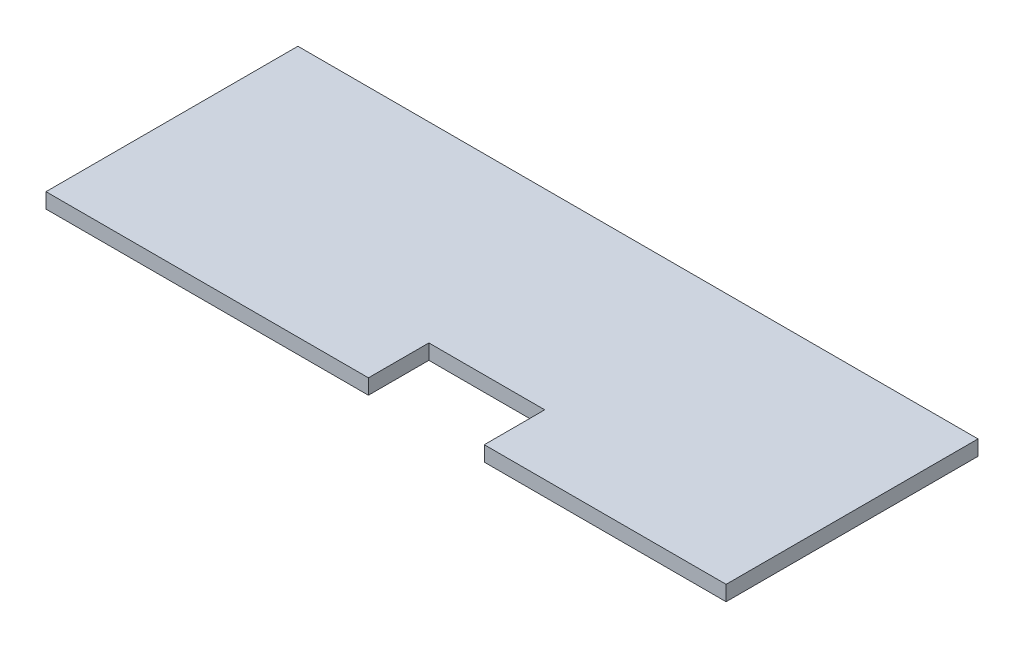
ISO-10303-21;
HEADER;
FILE_DESCRIPTION(('STEP AP214'),'2;1');
FILE_NAME('part.step','',(''),(''),'','','');
FILE_SCHEMA(('AUTOMOTIVE_DESIGN { 1 0 10303 214 1 1 1 1 }'));
ENDSEC;
DATA;
#1=APPLICATION_CONTEXT('core data for automotive mechanical design processes');
#2=APPLICATION_PROTOCOL_DEFINITION('international standard','automotive_design',2000,#1);
#3=PRODUCT_CONTEXT('',#1,'mechanical');
#4=PRODUCT('Part','Part','',(#3));
#5=PRODUCT_RELATED_PRODUCT_CATEGORY('part','',(#4));
#6=PRODUCT_DEFINITION_FORMATION('','',#4);
#7=PRODUCT_DEFINITION_CONTEXT('part definition',#1,'design');
#8=PRODUCT_DEFINITION('design','',#6,#7);
#9=PRODUCT_DEFINITION_SHAPE('','',#8);
#10=(LENGTH_UNIT() NAMED_UNIT(*) SI_UNIT(.MILLI.,.METRE.));
#11=(NAMED_UNIT(*) PLANE_ANGLE_UNIT() SI_UNIT($,.RADIAN.));
#12=(NAMED_UNIT(*) SI_UNIT($,.STERADIAN.) SOLID_ANGLE_UNIT());
#13=UNCERTAINTY_MEASURE_WITH_UNIT(LENGTH_MEASURE(1.E-05),#10,'distance_accuracy_value','');
#14=(GEOMETRIC_REPRESENTATION_CONTEXT(3) GLOBAL_UNCERTAINTY_ASSIGNED_CONTEXT((#13)) GLOBAL_UNIT_ASSIGNED_CONTEXT((#10,
#11,#12)) REPRESENTATION_CONTEXT('',''));
#15=CARTESIAN_POINT('',(0.,0.,0.));
#16=DIRECTION('',(0.,0.,1.));
#17=DIRECTION('',(1.,0.,0.));
#18=AXIS2_PLACEMENT_3D('',#15,#16,#17);
#19=CARTESIAN_POINT('',(19.5,3.,0.));
#20=DIRECTION('',(-1.,0.,0.));
#21=DIRECTION('',(0.,0.,1.));
#22=AXIS2_PLACEMENT_3D('',#19,#20,#21);
#23=PLANE('',#22);
#24=DIRECTION('',(0.,0.,-1.));
#25=VECTOR('',#24,1.);
#26=CARTESIAN_POINT('',(19.5,0.,0.));
#27=LINE('',#26,#25);
#28=CARTESIAN_POINT('',(19.5,0.,25.));
#29=VERTEX_POINT('',#28);
#30=CARTESIAN_POINT('',(19.5,0.,13.));
#31=VERTEX_POINT('',#30);
#32=EDGE_CURVE('E131',#29,#31,#27,.T.);
#33=ORIENTED_EDGE('',*,*,#32,.F.);
#34=DIRECTION('',(0.,-1.,0.));
#35=VECTOR('',#34,1.);
#36=CARTESIAN_POINT('',(19.5,3.,25.));
#37=LINE('',#36,#35);
#38=CARTESIAN_POINT('',(19.5,3.,25.));
#39=VERTEX_POINT('',#38);
#40=EDGE_CURVE('E11',#39,#29,#37,.T.);
#41=ORIENTED_EDGE('',*,*,#40,.F.);
#42=DIRECTION('',(0.,0.,-1.));
#43=VECTOR('',#42,1.);
#44=CARTESIAN_POINT('',(19.5,3.,0.));
#45=LINE('',#44,#43);
#46=CARTESIAN_POINT('',(19.5,3.,13.));
#47=VERTEX_POINT('',#46);
#48=EDGE_CURVE('E148',#39,#47,#45,.T.);
#49=ORIENTED_EDGE('',*,*,#48,.T.);
#50=DIRECTION('',(0.,-1.,0.));
#51=VECTOR('',#50,1.);
#52=CARTESIAN_POINT('',(19.5,3.,13.));
#53=LINE('',#52,#51);
#54=EDGE_CURVE('E87',#47,#31,#53,.T.);
#55=ORIENTED_EDGE('',*,*,#54,.T.);
#56=EDGE_LOOP('',(#33,#41,#49,#55));
#57=FACE_BOUND('',#56,.T.);
#58=ADVANCED_FACE('F36',(#57),#23,.T.);
#59=CARTESIAN_POINT('',(0.,3.,25.));
#60=DIRECTION('',(0.,0.,-1.));
#61=DIRECTION('',(-1.,0.,0.));
#62=AXIS2_PLACEMENT_3D('',#59,#60,#61);
#63=PLANE('',#62);
#64=DIRECTION('',(1.,0.,0.));
#65=VECTOR('',#64,1.);
#66=CARTESIAN_POINT('',(0.,0.,25.));
#67=LINE('',#66,#65);
#68=CARTESIAN_POINT('',(67.5,0.,25.));
#69=VERTEX_POINT('',#68);
#70=EDGE_CURVE('E134',#29,#69,#67,.T.);
#71=ORIENTED_EDGE('',*,*,#70,.T.);
#72=DIRECTION('',(0.,-1.,0.));
#73=VECTOR('',#72,1.);
#74=CARTESIAN_POINT('',(67.5,3.,25.));
#75=LINE('',#74,#73);
#76=CARTESIAN_POINT('',(67.5,3.,25.));
#77=VERTEX_POINT('',#76);
#78=EDGE_CURVE('E44',#77,#69,#75,.T.);
#79=ORIENTED_EDGE('',*,*,#78,.F.);
#80=DIRECTION('',(1.,0.,0.));
#81=VECTOR('',#80,1.);
#82=CARTESIAN_POINT('',(0.,3.,25.));
#83=LINE('',#82,#81);
#84=EDGE_CURVE('E117',#39,#77,#83,.T.);
#85=ORIENTED_EDGE('',*,*,#84,.F.);
#86=ORIENTED_EDGE('',*,*,#40,.T.);
#87=EDGE_LOOP('',(#71,#79,#85,#86));
#88=FACE_BOUND('',#87,.T.);
#89=ADVANCED_FACE('F175',(#88),#63,.F.);
#90=CARTESIAN_POINT('',(67.5,3.,0.));
#91=DIRECTION('',(-1.,0.,0.));
#92=DIRECTION('',(0.,0.,1.));
#93=AXIS2_PLACEMENT_3D('',#90,#91,#92);
#94=PLANE('',#93);
#95=DIRECTION('',(0.,0.,-1.));
#96=VECTOR('',#95,1.);
#97=CARTESIAN_POINT('',(67.5,0.,0.));
#98=LINE('',#97,#96);
#99=CARTESIAN_POINT('',(67.5,0.,-25.));
#100=VERTEX_POINT('',#99);
#101=EDGE_CURVE('E136',#69,#100,#98,.T.);
#102=ORIENTED_EDGE('',*,*,#101,.T.);
#103=DIRECTION('',(0.,-1.,0.));
#104=VECTOR('',#103,1.);
#105=CARTESIAN_POINT('',(67.5,3.,-25.));
#106=LINE('',#105,#104);
#107=CARTESIAN_POINT('',(67.5,3.,-25.));
#108=VERTEX_POINT('',#107);
#109=EDGE_CURVE('E154',#108,#100,#106,.T.);
#110=ORIENTED_EDGE('',*,*,#109,.F.);
#111=DIRECTION('',(0.,0.,-1.));
#112=VECTOR('',#111,1.);
#113=CARTESIAN_POINT('',(67.5,3.,0.));
#114=LINE('',#113,#112);
#115=EDGE_CURVE('E162',#77,#108,#114,.T.);
#116=ORIENTED_EDGE('',*,*,#115,.F.);
#117=ORIENTED_EDGE('',*,*,#78,.T.);
#118=EDGE_LOOP('',(#102,#110,#116,#117));
#119=FACE_BOUND('',#118,.T.);
#120=ADVANCED_FACE('F160',(#119),#94,.F.);
#121=CARTESIAN_POINT('',(0.,3.,-25.));
#122=DIRECTION('',(0.,0.,-1.));
#123=DIRECTION('',(-1.,0.,0.));
#124=AXIS2_PLACEMENT_3D('',#121,#122,#123);
#125=PLANE('',#124);
#126=DIRECTION('',(1.,0.,0.));
#127=VECTOR('',#126,1.);
#128=CARTESIAN_POINT('',(0.,0.,-25.));
#129=LINE('',#128,#127);
#130=CARTESIAN_POINT('',(-67.5,0.,-25.));
#131=VERTEX_POINT('',#130);
#132=EDGE_CURVE('E139',#131,#100,#129,.T.);
#133=ORIENTED_EDGE('',*,*,#132,.F.);
#134=DIRECTION('',(0.,-1.,0.));
#135=VECTOR('',#134,1.);
#136=CARTESIAN_POINT('',(-67.5,3.,-25.));
#137=LINE('',#136,#135);
#138=CARTESIAN_POINT('',(-67.5,3.,-25.));
#139=VERTEX_POINT('',#138);
#140=EDGE_CURVE('E152',#139,#131,#137,.T.);
#141=ORIENTED_EDGE('',*,*,#140,.F.);
#142=DIRECTION('',(1.,0.,0.));
#143=VECTOR('',#142,1.);
#144=CARTESIAN_POINT('',(0.,3.,-25.));
#145=LINE('',#144,#143);
#146=EDGE_CURVE('E172',#139,#108,#145,.T.);
#147=ORIENTED_EDGE('',*,*,#146,.T.);
#148=ORIENTED_EDGE('',*,*,#109,.T.);
#149=EDGE_LOOP('',(#133,#141,#147,#148));
#150=FACE_BOUND('',#149,.T.);
#151=ADVANCED_FACE('F170',(#150),#125,.T.);
#152=CARTESIAN_POINT('',(-67.5,3.,0.));
#153=DIRECTION('',(-1.,0.,0.));
#154=DIRECTION('',(0.,0.,1.));
#155=AXIS2_PLACEMENT_3D('',#152,#153,#154);
#156=PLANE('',#155);
#157=DIRECTION('',(0.,0.,-1.));
#158=VECTOR('',#157,1.);
#159=CARTESIAN_POINT('',(-67.5,0.,0.));
#160=LINE('',#159,#158);
#161=CARTESIAN_POINT('',(-67.5,0.,25.));
#162=VERTEX_POINT('',#161);
#163=EDGE_CURVE('E142',#162,#131,#160,.T.);
#164=ORIENTED_EDGE('',*,*,#163,.F.);
#165=DIRECTION('',(0.,-1.,0.));
#166=VECTOR('',#165,1.);
#167=CARTESIAN_POINT('',(-67.5,3.,25.));
#168=LINE('',#167,#166);
#169=CARTESIAN_POINT('',(-67.5,3.,25.));
#170=VERTEX_POINT('',#169);
#171=EDGE_CURVE('E122',#170,#162,#168,.T.);
#172=ORIENTED_EDGE('',*,*,#171,.F.);
#173=DIRECTION('',(0.,0.,-1.));
#174=VECTOR('',#173,1.);
#175=CARTESIAN_POINT('',(-67.5,3.,0.));
#176=LINE('',#175,#174);
#177=EDGE_CURVE('E114',#170,#139,#176,.T.);
#178=ORIENTED_EDGE('',*,*,#177,.T.);
#179=ORIENTED_EDGE('',*,*,#140,.T.);
#180=EDGE_LOOP('',(#164,#172,#178,#179));
#181=FACE_BOUND('',#180,.T.);
#182=ADVANCED_FACE('F185',(#181),#156,.T.);
#183=CARTESIAN_POINT('',(-3.50000000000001,0.,25.));
#184=VERTEX_POINT('',#183);
#185=EDGE_CURVE('E121',#162,#184,#67,.T.);
#186=ORIENTED_EDGE('',*,*,#185,.T.);
#187=DIRECTION('',(0.,-1.,0.));
#188=VECTOR('',#187,1.);
#189=CARTESIAN_POINT('',(-3.50000000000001,3.,25.));
#190=LINE('',#189,#188);
#191=CARTESIAN_POINT('',(-3.50000000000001,3.,25.));
#192=VERTEX_POINT('',#191);
#193=EDGE_CURVE('E118',#192,#184,#190,.T.);
#194=ORIENTED_EDGE('',*,*,#193,.F.);
#195=EDGE_CURVE('E107',#170,#192,#83,.T.);
#196=ORIENTED_EDGE('',*,*,#195,.F.);
#197=ORIENTED_EDGE('',*,*,#171,.T.);
#198=EDGE_LOOP('',(#186,#194,#196,#197));
#199=FACE_BOUND('',#198,.T.);
#200=ADVANCED_FACE('F119',(#199),#63,.F.);
#201=CARTESIAN_POINT('',(-3.50000000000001,3.,0.));
#202=DIRECTION('',(-1.,0.,0.));
#203=DIRECTION('',(0.,0.,1.));
#204=AXIS2_PLACEMENT_3D('',#201,#202,#203);
#205=PLANE('',#204);
#206=DIRECTION('',(0.,0.,-1.));
#207=VECTOR('',#206,1.);
#208=CARTESIAN_POINT('',(-3.50000000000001,0.,0.));
#209=LINE('',#208,#207);
#210=CARTESIAN_POINT('',(-3.50000000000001,0.,13.));
#211=VERTEX_POINT('',#210);
#212=EDGE_CURVE('E80',#184,#211,#209,.T.);
#213=ORIENTED_EDGE('',*,*,#212,.T.);
#214=DIRECTION('',(0.,-1.,0.));
#215=VECTOR('',#214,1.);
#216=CARTESIAN_POINT('',(-3.50000000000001,3.,13.));
#217=LINE('',#216,#215);
#218=CARTESIAN_POINT('',(-3.50000000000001,3.,13.));
#219=VERTEX_POINT('',#218);
#220=EDGE_CURVE('E123',#219,#211,#217,.T.);
#221=ORIENTED_EDGE('',*,*,#220,.F.);
#222=DIRECTION('',(0.,0.,-1.));
#223=VECTOR('',#222,1.);
#224=CARTESIAN_POINT('',(-3.50000000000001,3.,0.));
#225=LINE('',#224,#223);
#226=EDGE_CURVE('E111',#192,#219,#225,.T.);
#227=ORIENTED_EDGE('',*,*,#226,.F.);
#228=ORIENTED_EDGE('',*,*,#193,.T.);
#229=EDGE_LOOP('',(#213,#221,#227,#228));
#230=FACE_BOUND('',#229,.T.);
#231=ADVANCED_FACE('F125',(#230),#205,.F.);
#232=CARTESIAN_POINT('',(0.,3.,13.));
#233=DIRECTION('',(0.,0.,-1.));
#234=DIRECTION('',(-1.,0.,0.));
#235=AXIS2_PLACEMENT_3D('',#232,#233,#234);
#236=PLANE('',#235);
#237=DIRECTION('',(1.,0.,0.));
#238=VECTOR('',#237,1.);
#239=CARTESIAN_POINT('',(0.,0.,13.));
#240=LINE('',#239,#238);
#241=EDGE_CURVE('E146',#211,#31,#240,.T.);
#242=ORIENTED_EDGE('',*,*,#241,.T.);
#243=ORIENTED_EDGE('',*,*,#54,.F.);
#244=DIRECTION('',(1.,0.,0.));
#245=VECTOR('',#244,1.);
#246=CARTESIAN_POINT('',(0.,3.,13.));
#247=LINE('',#246,#245);
#248=EDGE_CURVE('E52',#219,#47,#247,.T.);
#249=ORIENTED_EDGE('',*,*,#248,.F.);
#250=ORIENTED_EDGE('',*,*,#220,.T.);
#251=EDGE_LOOP('',(#242,#243,#249,#250));
#252=FACE_BOUND('',#251,.T.);
#253=ADVANCED_FACE('F190',(#252),#236,.F.);
#254=CARTESIAN_POINT('',(0.,3.,0.));
#255=DIRECTION('',(0.,1.,0.));
#256=DIRECTION('',(0.,0.,1.));
#257=AXIS2_PLACEMENT_3D('',#254,#255,#256);
#258=PLANE('',#257);
#259=ORIENTED_EDGE('',*,*,#48,.F.);
#260=ORIENTED_EDGE('',*,*,#84,.T.);
#261=ORIENTED_EDGE('',*,*,#115,.T.);
#262=ORIENTED_EDGE('',*,*,#146,.F.);
#263=ORIENTED_EDGE('',*,*,#177,.F.);
#264=ORIENTED_EDGE('',*,*,#195,.T.);
#265=ORIENTED_EDGE('',*,*,#226,.T.);
#266=ORIENTED_EDGE('',*,*,#248,.T.);
#267=EDGE_LOOP('',(#259,#260,#261,#262,#263,#264,#265,#266));
#268=FACE_BOUND('',#267,.T.);
#269=ADVANCED_FACE('F109',(#268),#258,.T.);
#270=CARTESIAN_POINT('',(0.,0.,0.));
#271=DIRECTION('',(0.,1.,0.));
#272=DIRECTION('',(0.,0.,1.));
#273=AXIS2_PLACEMENT_3D('',#270,#271,#272);
#274=PLANE('',#273);
#275=ORIENTED_EDGE('',*,*,#32,.T.);
#276=ORIENTED_EDGE('',*,*,#241,.F.);
#277=ORIENTED_EDGE('',*,*,#212,.F.);
#278=ORIENTED_EDGE('',*,*,#185,.F.);
#279=ORIENTED_EDGE('',*,*,#163,.T.);
#280=ORIENTED_EDGE('',*,*,#132,.T.);
#281=ORIENTED_EDGE('',*,*,#101,.F.);
#282=ORIENTED_EDGE('',*,*,#70,.F.);
#283=EDGE_LOOP('',(#275,#276,#277,#278,#279,#280,#281,#282));
#284=FACE_BOUND('',#283,.T.);
#285=ADVANCED_FACE('F166',(#284),#274,.F.);
#286=CLOSED_SHELL('',(#58,#89,#120,#151,#182,#200,#231,#253,#269,#285));
#287=MANIFOLD_SOLID_BREP('B2',#286);
#288=ADVANCED_BREP_SHAPE_REPRESENTATION('',(#18,#287),#14);
#289=SHAPE_DEFINITION_REPRESENTATION(#9,#288);
ENDSEC;
END-ISO-10303-21;
